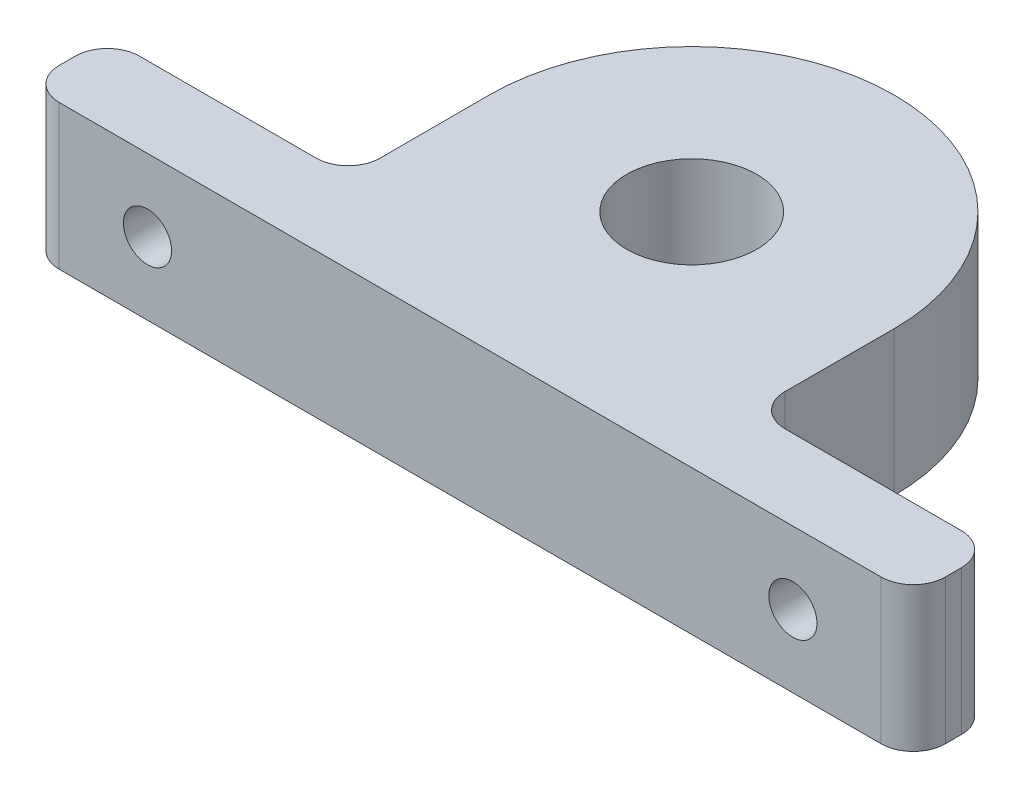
from build123d import *

# Parameters (mm, degrees)
SKETCH1_R           = 4.05
BOSS_EXTRUDE1_DEPTH = 9
FILLET1_R           = 2
SKETCH2_R           = 1.5
CUT_EXTRUDE1_DEPTH  = 10


with BuildPart() as part:
    # Sketch1 → Boss-Extrude1 (new body)
    with BuildSketch(Plane(origin=(0, 0, 0), x_dir=(1, 0, 0), z_dir=(0, 1, 0))):
        with BuildLine():
            Line((-27.6, -13.8), (27.6, -13.8))
            Line((27.6, -13.8), (27.6, -8.8))
            Line((27.6, -8.8), (12.6, -8.8))
            Line((12.6, -8.8), (12.610454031, 0))
            ThreePointArc((12.610454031, 0), (0, 12.610454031), (-12.610454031, 0))
            Line((-12.610454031, 0), (-12.6, -8.8))
            Line((-12.6, -8.8), (-27.6, -8.8))
            Line((-27.6, -8.8), (-27.6, -13.8))
        make_face()
        with Locations(Location((0, 0, 0), (0, 0, 270))):
            Circle(SKETCH1_R, mode=Mode.SUBTRACT)
    extrude(amount=BOSS_EXTRUDE1_DEPTH)

    # Fillet1
    fillet1_edges = [part.edges().sort_by_distance(p)[0] for p in [
        (-27.6, 4.5, 8.8),
        (-12.6, 4.5, 8.8),
        (12.6, 4.5, 8.8),
        (27.6, 4.5, 8.8),
        (27.6, 4.5, 13.8),
        (-27.6, 4.5, 13.8),
    ]]
    fillet(fillet1_edges, radius=FILLET1_R)

    # Sketch2 → Cut-Extrude1 (cut)
    with BuildSketch(Plane(origin=(0, 0, 8.8), x_dir=(-1, 0, 0), z_dir=(0, 0, -1))):
        with Locations((20.101188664, 4.5)):
            Circle(SKETCH2_R)
        with Locations((-20.101188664, 4.5)):
            Circle(SKETCH2_R)
    extrude(amount=-CUT_EXTRUDE1_DEPTH, mode=Mode.SUBTRACT)


solid = part.part
